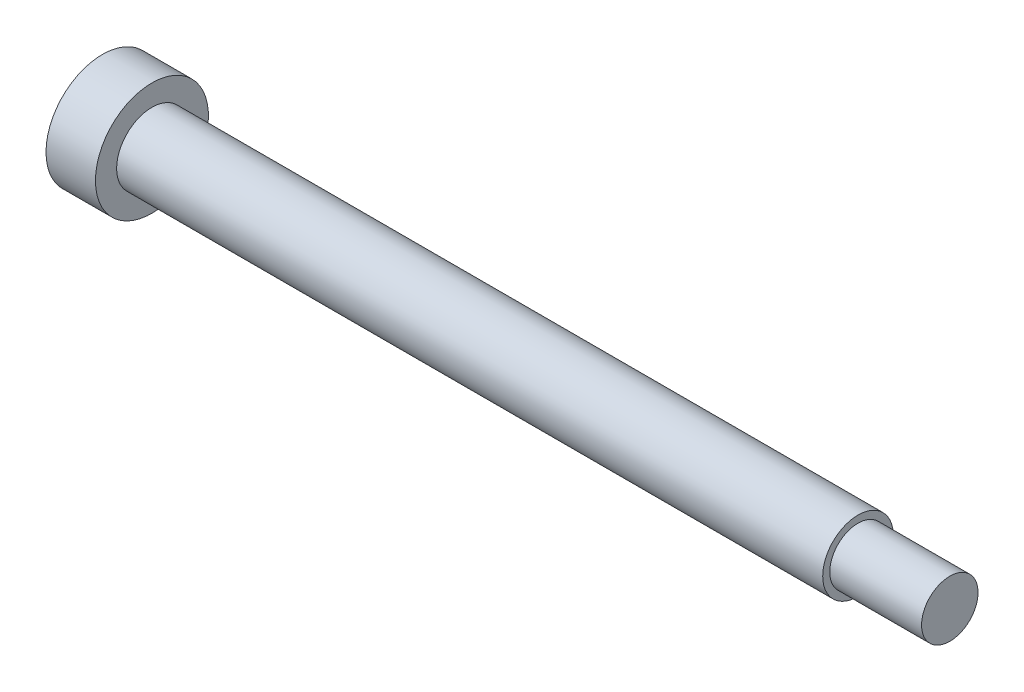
ISO-10303-21;
HEADER;
FILE_DESCRIPTION(('STEP AP214'),'2;1');
FILE_NAME('part.step','',(''),(''),'','','');
FILE_SCHEMA(('AUTOMOTIVE_DESIGN { 1 0 10303 214 1 1 1 1 }'));
ENDSEC;
DATA;
#1=APPLICATION_CONTEXT('core data for automotive mechanical design processes');
#2=APPLICATION_PROTOCOL_DEFINITION('international standard','automotive_design',2000,#1);
#3=PRODUCT_CONTEXT('',#1,'mechanical');
#4=PRODUCT('Part','Part','',(#3));
#5=PRODUCT_RELATED_PRODUCT_CATEGORY('part','',(#4));
#6=PRODUCT_DEFINITION_FORMATION('','',#4);
#7=PRODUCT_DEFINITION_CONTEXT('part definition',#1,'design');
#8=PRODUCT_DEFINITION('design','',#6,#7);
#9=PRODUCT_DEFINITION_SHAPE('','',#8);
#10=(LENGTH_UNIT() NAMED_UNIT(*) SI_UNIT(.MILLI.,.METRE.));
#11=(NAMED_UNIT(*) PLANE_ANGLE_UNIT() SI_UNIT($,.RADIAN.));
#12=(NAMED_UNIT(*) SI_UNIT($,.STERADIAN.) SOLID_ANGLE_UNIT());
#13=UNCERTAINTY_MEASURE_WITH_UNIT(LENGTH_MEASURE(1.E-05),#10,'distance_accuracy_value','');
#14=(GEOMETRIC_REPRESENTATION_CONTEXT(3) GLOBAL_UNCERTAINTY_ASSIGNED_CONTEXT((#13)) GLOBAL_UNIT_ASSIGNED_CONTEXT((#10,
#11,#12)) REPRESENTATION_CONTEXT('',''));
#15=CARTESIAN_POINT('',(0.,0.,0.));
#16=DIRECTION('',(0.,0.,1.));
#17=DIRECTION('',(1.,0.,0.));
#18=AXIS2_PLACEMENT_3D('',#15,#16,#17);
#19=CARTESIAN_POINT('',(0.,0.,0.));
#20=DIRECTION('',(1.,0.,0.));
#21=DIRECTION('',(0.,0.,-1.));
#22=AXIS2_PLACEMENT_3D('',#19,#20,#21);
#23=PLANE('',#22);
#24=DIRECTION('',(0.,0.866025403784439,-0.5));
#25=VECTOR('',#24,1.);
#26=CARTESIAN_POINT('',(0.,0.,2.5));
#27=LINE('',#26,#25);
#28=CARTESIAN_POINT('',(0.,0.,2.5));
#29=VERTEX_POINT('',#28);
#30=CARTESIAN_POINT('',(0.,2.1650635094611,1.25));
#31=VERTEX_POINT('',#30);
#32=EDGE_CURVE('E104',#29,#31,#27,.T.);
#33=ORIENTED_EDGE('',*,*,#32,.F.);
#34=DIRECTION('',(0.,0.866025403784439,0.5));
#35=VECTOR('',#34,1.);
#36=CARTESIAN_POINT('',(0.,-2.1650635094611,1.25));
#37=LINE('',#36,#35);
#38=CARTESIAN_POINT('',(0.,-2.1650635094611,1.25));
#39=VERTEX_POINT('',#38);
#40=EDGE_CURVE('E30',#39,#29,#37,.T.);
#41=ORIENTED_EDGE('',*,*,#40,.F.);
#42=DIRECTION('',(0.,0.,1.));
#43=VECTOR('',#42,1.);
#44=CARTESIAN_POINT('',(0.,-2.1650635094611,-1.25));
#45=LINE('',#44,#43);
#46=CARTESIAN_POINT('',(0.,-2.1650635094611,-1.25));
#47=VERTEX_POINT('',#46);
#48=EDGE_CURVE('E113',#47,#39,#45,.T.);
#49=ORIENTED_EDGE('',*,*,#48,.F.);
#50=DIRECTION('',(0.,-0.866025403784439,0.5));
#51=VECTOR('',#50,1.);
#52=CARTESIAN_POINT('',(0.,0.,-2.5));
#53=LINE('',#52,#51);
#54=CARTESIAN_POINT('',(0.,0.,-2.5));
#55=VERTEX_POINT('',#54);
#56=EDGE_CURVE('E111',#55,#47,#53,.T.);
#57=ORIENTED_EDGE('',*,*,#56,.F.);
#58=DIRECTION('',(0.,-0.866025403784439,-0.5));
#59=VECTOR('',#58,1.);
#60=CARTESIAN_POINT('',(0.,2.1650635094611,-1.25));
#61=LINE('',#60,#59);
#62=CARTESIAN_POINT('',(0.,2.1650635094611,-1.25));
#63=VERTEX_POINT('',#62);
#64=EDGE_CURVE('E78',#63,#55,#61,.T.);
#65=ORIENTED_EDGE('',*,*,#64,.F.);
#66=DIRECTION('',(0.,0.,-1.));
#67=VECTOR('',#66,1.);
#68=CARTESIAN_POINT('',(0.,2.1650635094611,1.25));
#69=LINE('',#68,#67);
#70=EDGE_CURVE('E107',#31,#63,#69,.T.);
#71=ORIENTED_EDGE('',*,*,#70,.F.);
#72=EDGE_LOOP('',(#33,#41,#49,#57,#65,#71));
#73=FACE_BOUND('',#72,.T.);
#74=CARTESIAN_POINT('',(0.,0.,0.));
#75=DIRECTION('',(-1.,0.,0.));
#76=DIRECTION('',(0.,0.,1.));
#77=AXIS2_PLACEMENT_3D('',#74,#75,#76);
#78=CIRCLE('',#77,8.);
#79=CARTESIAN_POINT('',(0.,0.,8.));
#80=VERTEX_POINT('',#79);
#81=EDGE_CURVE('E10',#80,#80,#78,.T.);
#82=ORIENTED_EDGE('',*,*,#81,.T.);
#83=EDGE_LOOP('',(#82));
#84=FACE_BOUND('',#83,.T.);
#85=ADVANCED_FACE('F16',(#73,#84),#23,.F.);
#86=CARTESIAN_POINT('',(0.,0.,0.));
#87=DIRECTION('',(-1.,0.,0.));
#88=DIRECTION('',(0.,0.,1.));
#89=AXIS2_PLACEMENT_3D('',#86,#87,#88);
#90=CYLINDRICAL_SURFACE('',#89,8.);
#91=ORIENTED_EDGE('',*,*,#81,.F.);
#92=EDGE_LOOP('',(#91));
#93=FACE_BOUND('',#92,.T.);
#94=CARTESIAN_POINT('',(7.,0.,0.));
#95=DIRECTION('',(-1.,0.,0.));
#96=DIRECTION('',(0.,0.,1.));
#97=AXIS2_PLACEMENT_3D('',#94,#95,#96);
#98=CIRCLE('',#97,8.);
#99=CARTESIAN_POINT('',(7.,0.,8.));
#100=VERTEX_POINT('',#99);
#101=EDGE_CURVE('E23',#100,#100,#98,.T.);
#102=ORIENTED_EDGE('',*,*,#101,.T.);
#103=EDGE_LOOP('',(#102));
#104=FACE_BOUND('',#103,.T.);
#105=ADVANCED_FACE('F136',(#93,#104),#90,.T.);
#106=CARTESIAN_POINT('',(7.,8.,0.));
#107=DIRECTION('',(-1.,0.,0.));
#108=DIRECTION('',(0.,0.,1.));
#109=AXIS2_PLACEMENT_3D('',#106,#107,#108);
#110=PLANE('',#109);
#111=ORIENTED_EDGE('',*,*,#101,.F.);
#112=EDGE_LOOP('',(#111));
#113=FACE_BOUND('',#112,.T.);
#114=CARTESIAN_POINT('',(7.,0.,0.));
#115=DIRECTION('',(-1.,0.,0.));
#116=DIRECTION('',(0.,0.,1.));
#117=AXIS2_PLACEMENT_3D('',#114,#115,#116);
#118=CIRCLE('',#117,5.);
#119=CARTESIAN_POINT('',(7.,0.,5.));
#120=VERTEX_POINT('',#119);
#121=EDGE_CURVE('E131',#120,#120,#118,.T.);
#122=ORIENTED_EDGE('',*,*,#121,.T.);
#123=EDGE_LOOP('',(#122));
#124=FACE_BOUND('',#123,.T.);
#125=ADVANCED_FACE('F138',(#113,#124),#110,.F.);
#126=CARTESIAN_POINT('',(0.,0.,0.));
#127=DIRECTION('',(-1.,0.,0.));
#128=DIRECTION('',(0.,0.,1.));
#129=AXIS2_PLACEMENT_3D('',#126,#127,#128);
#130=CYLINDRICAL_SURFACE('',#129,5.);
#131=ORIENTED_EDGE('',*,*,#121,.F.);
#132=EDGE_LOOP('',(#131));
#133=FACE_BOUND('',#132,.T.);
#134=CARTESIAN_POINT('',(107.,0.,0.));
#135=DIRECTION('',(-1.,0.,0.));
#136=DIRECTION('',(0.,0.,1.));
#137=AXIS2_PLACEMENT_3D('',#134,#135,#136);
#138=CIRCLE('',#137,5.);
#139=CARTESIAN_POINT('',(107.,0.,5.));
#140=VERTEX_POINT('',#139);
#141=EDGE_CURVE('E128',#140,#140,#138,.T.);
#142=ORIENTED_EDGE('',*,*,#141,.T.);
#143=EDGE_LOOP('',(#142));
#144=FACE_BOUND('',#143,.T.);
#145=ADVANCED_FACE('F141',(#133,#144),#130,.T.);
#146=CARTESIAN_POINT('',(107.,5.,0.));
#147=DIRECTION('',(-1.,0.,0.));
#148=DIRECTION('',(0.,0.,1.));
#149=AXIS2_PLACEMENT_3D('',#146,#147,#148);
#150=PLANE('',#149);
#151=ORIENTED_EDGE('',*,*,#141,.F.);
#152=EDGE_LOOP('',(#151));
#153=FACE_BOUND('',#152,.T.);
#154=CARTESIAN_POINT('',(107.,0.,0.));
#155=DIRECTION('',(-1.,0.,0.));
#156=DIRECTION('',(0.,0.,1.));
#157=AXIS2_PLACEMENT_3D('',#154,#155,#156);
#158=CIRCLE('',#157,4.);
#159=CARTESIAN_POINT('',(107.,0.,4.));
#160=VERTEX_POINT('',#159);
#161=EDGE_CURVE('E125',#160,#160,#158,.T.);
#162=ORIENTED_EDGE('',*,*,#161,.T.);
#163=EDGE_LOOP('',(#162));
#164=FACE_BOUND('',#163,.T.);
#165=ADVANCED_FACE('F147',(#153,#164),#150,.F.);
#166=CARTESIAN_POINT('',(0.,0.,0.));
#167=DIRECTION('',(-1.,0.,0.));
#168=DIRECTION('',(0.,0.,1.));
#169=AXIS2_PLACEMENT_3D('',#166,#167,#168);
#170=CYLINDRICAL_SURFACE('',#169,4.);
#171=ORIENTED_EDGE('',*,*,#161,.F.);
#172=EDGE_LOOP('',(#171));
#173=FACE_BOUND('',#172,.T.);
#174=CARTESIAN_POINT('',(120.,0.,0.));
#175=DIRECTION('',(-1.,0.,0.));
#176=DIRECTION('',(0.,0.,1.));
#177=AXIS2_PLACEMENT_3D('',#174,#175,#176);
#178=CIRCLE('',#177,4.);
#179=CARTESIAN_POINT('',(120.,0.,4.));
#180=VERTEX_POINT('',#179);
#181=EDGE_CURVE('E117',#180,#180,#178,.T.);
#182=ORIENTED_EDGE('',*,*,#181,.T.);
#183=EDGE_LOOP('',(#182));
#184=FACE_BOUND('',#183,.T.);
#185=ADVANCED_FACE('F153',(#173,#184),#170,.T.);
#186=CARTESIAN_POINT('',(120.,4.,0.));
#187=DIRECTION('',(-1.,0.,0.));
#188=DIRECTION('',(0.,0.,1.));
#189=AXIS2_PLACEMENT_3D('',#186,#187,#188);
#190=PLANE('',#189);
#191=ORIENTED_EDGE('',*,*,#181,.F.);
#192=EDGE_LOOP('',(#191));
#193=FACE_BOUND('',#192,.T.);
#194=ADVANCED_FACE('F159',(#193),#190,.F.);
#195=CARTESIAN_POINT('',(5.,-2.1650635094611,1.25));
#196=DIRECTION('',(0.,-0.5,0.866025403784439));
#197=DIRECTION('',(0.,-0.866025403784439,-0.5));
#198=AXIS2_PLACEMENT_3D('',#195,#196,#197);
#199=PLANE('',#198);
#200=ORIENTED_EDGE('',*,*,#40,.T.);
#201=DIRECTION('',(-1.,0.,0.));
#202=VECTOR('',#201,1.);
#203=CARTESIAN_POINT('',(5.,0.,2.5));
#204=LINE('',#203,#202);
#205=CARTESIAN_POINT('',(5.,0.,2.5));
#206=VERTEX_POINT('',#205);
#207=EDGE_CURVE('E60',#206,#29,#204,.T.);
#208=ORIENTED_EDGE('',*,*,#207,.F.);
#209=DIRECTION('',(0.,0.866025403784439,0.5));
#210=VECTOR('',#209,1.);
#211=CARTESIAN_POINT('',(5.,-2.1650635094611,1.25));
#212=LINE('',#211,#210);
#213=CARTESIAN_POINT('',(5.,-2.1650635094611,1.25));
#214=VERTEX_POINT('',#213);
#215=EDGE_CURVE('E115',#214,#206,#212,.T.);
#216=ORIENTED_EDGE('',*,*,#215,.F.);
#217=DIRECTION('',(-1.,0.,0.));
#218=VECTOR('',#217,1.);
#219=CARTESIAN_POINT('',(5.,-2.1650635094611,1.25));
#220=LINE('',#219,#218);
#221=EDGE_CURVE('E38',#214,#39,#220,.T.);
#222=ORIENTED_EDGE('',*,*,#221,.T.);
#223=EDGE_LOOP('',(#200,#208,#216,#222));
#224=FACE_BOUND('',#223,.T.);
#225=ADVANCED_FACE('F164',(#224),#199,.F.);
#226=CARTESIAN_POINT('',(5.,-2.1650635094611,-1.25));
#227=DIRECTION('',(0.,-1.,0.));
#228=DIRECTION('',(0.,0.,-1.));
#229=AXIS2_PLACEMENT_3D('',#226,#227,#228);
#230=PLANE('',#229);
#231=ORIENTED_EDGE('',*,*,#48,.T.);
#232=ORIENTED_EDGE('',*,*,#221,.F.);
#233=DIRECTION('',(0.,0.,1.));
#234=VECTOR('',#233,1.);
#235=CARTESIAN_POINT('',(5.,-2.1650635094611,-1.25));
#236=LINE('',#235,#234);
#237=CARTESIAN_POINT('',(5.,-2.1650635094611,-1.25));
#238=VERTEX_POINT('',#237);
#239=EDGE_CURVE('E90',#238,#214,#236,.T.);
#240=ORIENTED_EDGE('',*,*,#239,.F.);
#241=DIRECTION('',(-1.,0.,0.));
#242=VECTOR('',#241,1.);
#243=CARTESIAN_POINT('',(5.,-2.1650635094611,-1.25));
#244=LINE('',#243,#242);
#245=EDGE_CURVE('E82',#238,#47,#244,.T.);
#246=ORIENTED_EDGE('',*,*,#245,.T.);
#247=EDGE_LOOP('',(#231,#232,#240,#246));
#248=FACE_BOUND('',#247,.T.);
#249=ADVANCED_FACE('F171',(#248),#230,.F.);
#250=CARTESIAN_POINT('',(5.,0.,-2.5));
#251=DIRECTION('',(0.,-0.5,-0.866025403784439));
#252=DIRECTION('',(0.,0.866025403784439,-0.5));
#253=AXIS2_PLACEMENT_3D('',#250,#251,#252);
#254=PLANE('',#253);
#255=ORIENTED_EDGE('',*,*,#56,.T.);
#256=ORIENTED_EDGE('',*,*,#245,.F.);
#257=DIRECTION('',(0.,-0.866025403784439,0.5));
#258=VECTOR('',#257,1.);
#259=CARTESIAN_POINT('',(5.,0.,-2.5));
#260=LINE('',#259,#258);
#261=CARTESIAN_POINT('',(5.,0.,-2.5));
#262=VERTEX_POINT('',#261);
#263=EDGE_CURVE('E86',#262,#238,#260,.T.);
#264=ORIENTED_EDGE('',*,*,#263,.F.);
#265=DIRECTION('',(-1.,0.,0.));
#266=VECTOR('',#265,1.);
#267=CARTESIAN_POINT('',(5.,0.,-2.5));
#268=LINE('',#267,#266);
#269=EDGE_CURVE('E71',#262,#55,#268,.T.);
#270=ORIENTED_EDGE('',*,*,#269,.T.);
#271=EDGE_LOOP('',(#255,#256,#264,#270));
#272=FACE_BOUND('',#271,.T.);
#273=ADVANCED_FACE('F87',(#272),#254,.F.);
#274=CARTESIAN_POINT('',(5.,2.1650635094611,-1.25));
#275=DIRECTION('',(0.,0.5,-0.866025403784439));
#276=DIRECTION('',(0.,0.866025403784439,0.5));
#277=AXIS2_PLACEMENT_3D('',#274,#275,#276);
#278=PLANE('',#277);
#279=ORIENTED_EDGE('',*,*,#64,.T.);
#280=ORIENTED_EDGE('',*,*,#269,.F.);
#281=DIRECTION('',(0.,-0.866025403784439,-0.5));
#282=VECTOR('',#281,1.);
#283=CARTESIAN_POINT('',(5.,2.1650635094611,-1.25));
#284=LINE('',#283,#282);
#285=CARTESIAN_POINT('',(5.,2.1650635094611,-1.25));
#286=VERTEX_POINT('',#285);
#287=EDGE_CURVE('E75',#286,#262,#284,.T.);
#288=ORIENTED_EDGE('',*,*,#287,.F.);
#289=DIRECTION('',(-1.,0.,0.));
#290=VECTOR('',#289,1.);
#291=CARTESIAN_POINT('',(5.,2.1650635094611,-1.25));
#292=LINE('',#291,#290);
#293=EDGE_CURVE('E83',#286,#63,#292,.T.);
#294=ORIENTED_EDGE('',*,*,#293,.T.);
#295=EDGE_LOOP('',(#279,#280,#288,#294));
#296=FACE_BOUND('',#295,.T.);
#297=ADVANCED_FACE('F73',(#296),#278,.F.);
#298=CARTESIAN_POINT('',(5.,2.1650635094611,1.25));
#299=DIRECTION('',(0.,1.,0.));
#300=DIRECTION('',(0.,0.,1.));
#301=AXIS2_PLACEMENT_3D('',#298,#299,#300);
#302=PLANE('',#301);
#303=ORIENTED_EDGE('',*,*,#70,.T.);
#304=ORIENTED_EDGE('',*,*,#293,.F.);
#305=DIRECTION('',(0.,0.,-1.));
#306=VECTOR('',#305,1.);
#307=CARTESIAN_POINT('',(5.,2.1650635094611,1.25));
#308=LINE('',#307,#306);
#309=CARTESIAN_POINT('',(5.,2.1650635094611,1.25));
#310=VERTEX_POINT('',#309);
#311=EDGE_CURVE('E96',#310,#286,#308,.T.);
#312=ORIENTED_EDGE('',*,*,#311,.F.);
#313=DIRECTION('',(-1.,0.,0.));
#314=VECTOR('',#313,1.);
#315=CARTESIAN_POINT('',(5.,2.1650635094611,1.25));
#316=LINE('',#315,#314);
#317=EDGE_CURVE('E120',#310,#31,#316,.T.);
#318=ORIENTED_EDGE('',*,*,#317,.T.);
#319=EDGE_LOOP('',(#303,#304,#312,#318));
#320=FACE_BOUND('',#319,.T.);
#321=ADVANCED_FACE('F199',(#320),#302,.F.);
#322=CARTESIAN_POINT('',(5.,0.,2.5));
#323=DIRECTION('',(0.,0.5,0.866025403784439));
#324=DIRECTION('',(0.,-0.866025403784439,0.5));
#325=AXIS2_PLACEMENT_3D('',#322,#323,#324);
#326=PLANE('',#325);
#327=ORIENTED_EDGE('',*,*,#32,.T.);
#328=ORIENTED_EDGE('',*,*,#317,.F.);
#329=DIRECTION('',(0.,0.866025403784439,-0.5));
#330=VECTOR('',#329,1.);
#331=CARTESIAN_POINT('',(5.,0.,2.5));
#332=LINE('',#331,#330);
#333=EDGE_CURVE('E98',#206,#310,#332,.T.);
#334=ORIENTED_EDGE('',*,*,#333,.F.);
#335=ORIENTED_EDGE('',*,*,#207,.T.);
#336=EDGE_LOOP('',(#327,#328,#334,#335));
#337=FACE_BOUND('',#336,.T.);
#338=ADVANCED_FACE('F186',(#337),#326,.F.);
#339=CARTESIAN_POINT('',(5.,0.,0.));
#340=DIRECTION('',(-1.,0.,0.));
#341=DIRECTION('',(0.,0.,1.));
#342=AXIS2_PLACEMENT_3D('',#339,#340,#341);
#343=PLANE('',#342);
#344=ORIENTED_EDGE('',*,*,#215,.T.);
#345=ORIENTED_EDGE('',*,*,#333,.T.);
#346=ORIENTED_EDGE('',*,*,#311,.T.);
#347=ORIENTED_EDGE('',*,*,#287,.T.);
#348=ORIENTED_EDGE('',*,*,#263,.T.);
#349=ORIENTED_EDGE('',*,*,#239,.T.);
#350=EDGE_LOOP('',(#344,#345,#346,#347,#348,#349));
#351=FACE_BOUND('',#350,.T.);
#352=ADVANCED_FACE('F93',(#351),#343,.T.);
#353=CLOSED_SHELL('',(#85,#105,#125,#145,#165,#185,#194,#225,#249,#273,#297,#321,#338,#352));
#354=MANIFOLD_SOLID_BREP('B1',#353);
#355=ADVANCED_BREP_SHAPE_REPRESENTATION('',(#18,#354),#14);
#356=SHAPE_DEFINITION_REPRESENTATION(#9,#355);
ENDSEC;
END-ISO-10303-21;
